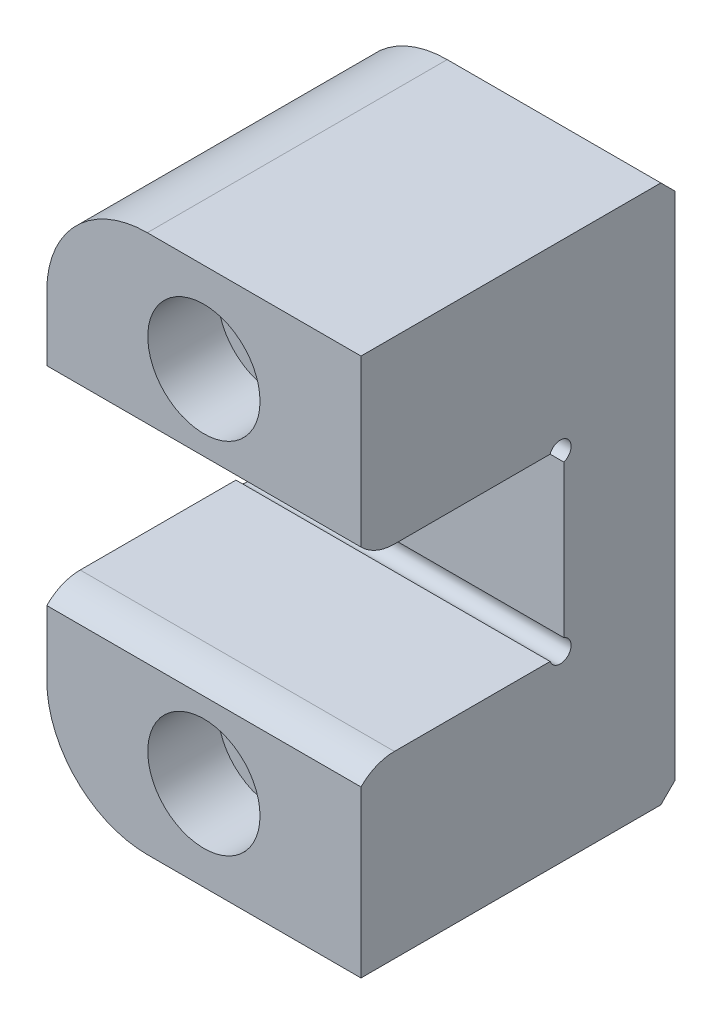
from build123d import *

# Parameters (mm, degrees)
EXTRUDE1_DEPTH                                 = 11.1125
FILLET1_R                                      = 7.112
CUT_EXTRUDE1_DEPTH                             = 37.753282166
CUT_EXTRUDE2_DEPTH                             = 37.753282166
SKETCH6_R                                      = 0.762
CUT_EXTRUDE3_DEPTH                             = 37.753282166
CBORE_FOR_8_SOCKET_HEAD_CAP_SCREW1_D           = 4.9149
CBORE_FOR_8_SOCKET_HEAD_CAP_SCREW1_CBORE_D     = 7.9375
CBORE_FOR_8_SOCKET_HEAD_CAP_SCREW1_CBORE_DEPTH = 4.96062
CHAMFER3_SIZE                                  = 3.81
CHAMFER3_SIZE2                                 = 1.020886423
CHAMFER1_SIZE                                  = 1.016


with BuildPart() as part:
    # Sketch1 → Extrude1 (new, symmetric)
    with BuildSketch(Plane(origin=(0, 0, 0), x_dir=(0, 0, -1), z_dir=(1, 0, 0))):
        Polygon((0, 6.35), (14.351, 6.35), (14.351, -6.35), (0, -6.35), (0, -19.05), (22.225, -19.05), (22.225, 19.05), (0, 19.05), align=None)
    extrude(amount=EXTRUDE1_DEPTH, both=True)

    # Fillet1
    fillet1_edges = [part.edges().sort_by_distance(p)[0] for p in [
        (-11.1125, 19.05, -11.1125),
        (-11.1125, -19.05, -11.1125),
    ]]
    fillet(fillet1_edges, radius=FILLET1_R)

    # Sketch2 → Cut-Extrude1 (cut, through all)
    with BuildSketch(Plane(origin=(-11.1125, 0, -22.225), x_dir=(1, 0, 0), z_dir=(0, 0, 1))):
        Polygon((-1.5875, 5.679043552), (-1.5875, -5.679043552), (1.5875, -3.845956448), (1.5875, 3.845956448), align=None)
    extrude(amount=CUT_EXTRUDE1_DEPTH, mode=Mode.SUBTRACT)

    # Sketch5 → Cut-Extrude2 (cut, through all)
    with BuildSketch(Plane(origin=(11.1125, 0, 0), x_dir=(0, 0, -1), z_dir=(1, 0, 0))):
        with BuildLine():
            Line((-3.9878, -4.171019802), (2.3622, -4.171019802))
            Line((2.3622, -4.171019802), (2.3622, -6.35))
            ThreePointArc((2.3622, -6.35), (1.080400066, -6.60918595), (0, -7.346019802))
            Line((0, -7.346019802), (-3.9878, -7.346019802))
            Line((-3.9878, -7.346019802), (-3.9878, -4.171019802))
        make_face()
        with BuildLine():
            Line((2.3622, 4.171019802), (2.3622, 6.35))
            ThreePointArc((2.3622, 6.35), (1.080400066, 6.60918595), (0, 7.346019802))
            Line((0, 7.346019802), (-3.9878, 7.346019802))
            Line((-3.9878, 7.346019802), (-3.9878, 4.171019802))
            Line((-3.9878, 4.171019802), (2.3622, 4.171019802))
        make_face()
    extrude(amount=-CUT_EXTRUDE2_DEPTH, mode=Mode.SUBTRACT)

    # Sketch6 → Cut-Extrude3 (cut, through all)
    with BuildSketch(Plane(origin=(11.1125, 0, 0), x_dir=(0, 0, -1), z_dir=(1, 0, 0))):
        with Locations((14.097, 6.096)):
            Circle(SKETCH6_R)
        with Locations((14.097, -6.096)):
            Circle(SKETCH6_R)
    extrude(amount=-CUT_EXTRUDE3_DEPTH, mode=Mode.SUBTRACT)

    # CBORE for _8 Socket Head Cap Screw1 (through all)
    with Locations(Plane.XY):
        with Locations((0, 12.7), (0, -12.7)):
            CounterBoreHole(CBORE_FOR_8_SOCKET_HEAD_CAP_SCREW1_D / 2, CBORE_FOR_8_SOCKET_HEAD_CAP_SCREW1_CBORE_D / 2, CBORE_FOR_8_SOCKET_HEAD_CAP_SCREW1_CBORE_DEPTH)

    # Chamfer3
    chamfer3_edges = [part.edges().sort_by_distance(p)[0] for p in [
        (-9.525, 0, -14.351),
    ]]
    chamfer3_side = [part.faces().sort_by_distance(p)[0] for p in [
        (-9.525, 0, -18.288),
    ]]
    chamfer(chamfer3_edges, length=CHAMFER3_SIZE, length2=CHAMFER3_SIZE2, reference=chamfer3_side[0])

    # Chamfer1
    chamfer1_edges = [part.edges().sort_by_distance(p)[0] for p in [
        (3.556, 19.05, -22.225),
        (3.556, -19.05, -22.225),
        (-11.1125, -8.35025, -22.225),
        (-9.029443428, 16.966943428, -22.225),
        (-9.029443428, -16.966943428, -22.225),
        (-11.1125, 8.35025, -22.225),
    ]]
    chamfer(chamfer1_edges, length=CHAMFER1_SIZE)


solid = part.part
